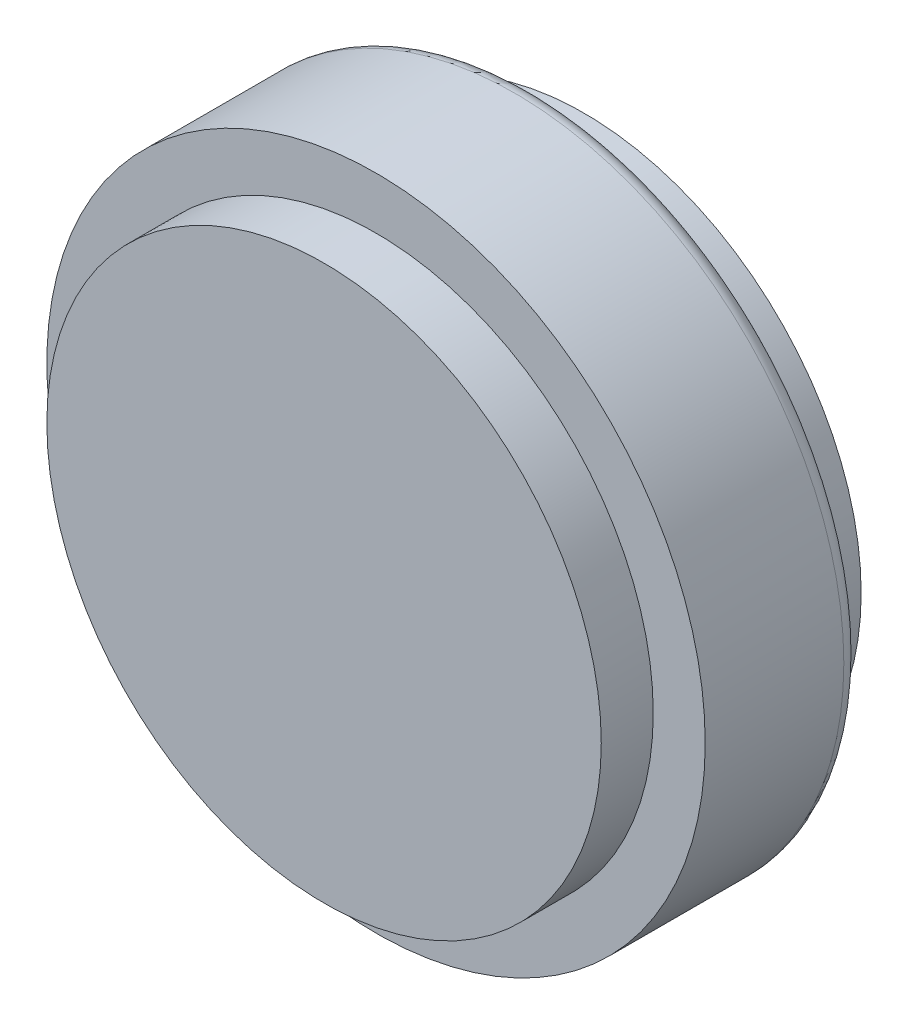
from build123d import *

# Parameters (mm, degrees)
FILLET1_R    = 1
SCALE1_SCALE = 2


with BuildPart() as part:
    # Sketch2 → Revolve1 (revolve)
    with BuildSketch(Plane(origin=(0, 0, 0), x_dir=(0, 0, -1), z_dir=(1, 0, 0)), mode=Mode.PRIVATE) as revolve1_sk:
        Polygon((0, 0), (15, 0), (15, 16), (12, 16), (12, 19), (3, 19), (3, 16), (0, 16), align=None)
    revolve(revolve1_sk.sketch.rotate(Axis((0, 0, 0), (0, 0, -1)), 90), axis=Axis((0, 0, 0), (0, 0, -1)))

    # Fillet1
    fillet1_edges = [part.edges().sort_by_distance(p)[0] for p in [
        (-19, 0, -12),
    ]]
    fillet(fillet1_edges, radius=FILLET1_R)


with BuildPart() as part_1:
    # Scale1: scaled about (0, 0, -7.492786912)
    add(part.part.scale(SCALE1_SCALE).moved(Location((0, 0, 7.492786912))))


solid = part_1.part
